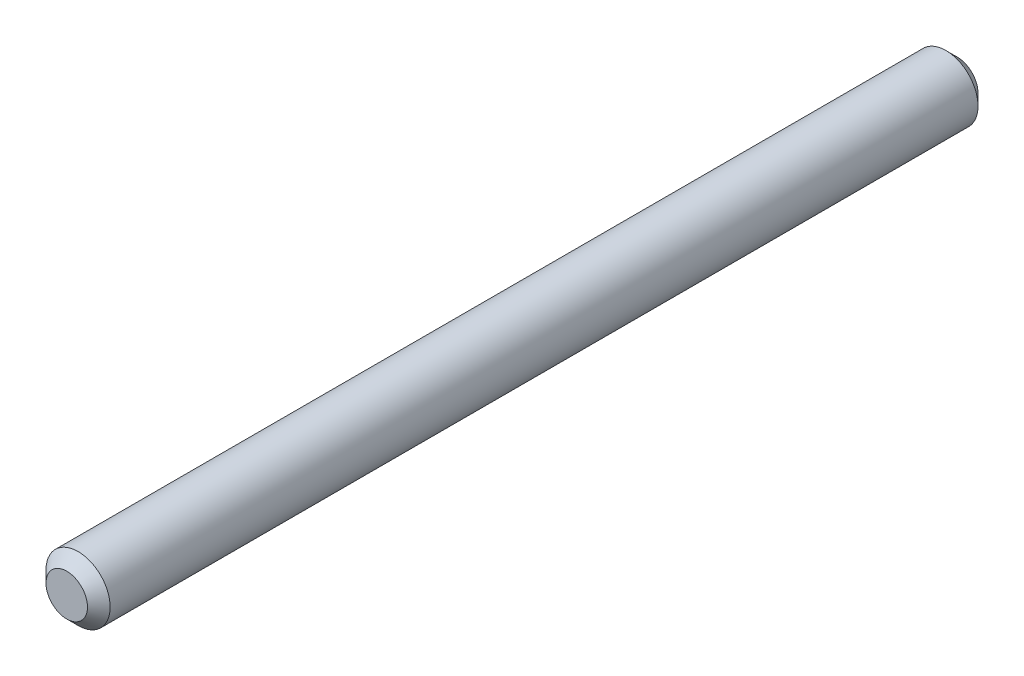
from build123d import *

# Parameters (mm, degrees)
ESQUISSE1_R        = 1.98
BOSS_EXTRU_1_DEPTH = 54.96
CHANFREIN1_SIZE    = 0.7


with BuildPart() as part:
    # Esquisse1 → Boss.-Extru.1 (new body)
    with BuildSketch(Plane.XY):
        with Locations(Location((0, 0, 0), (0, 0, 180))):
            Circle(ESQUISSE1_R)
    extrude(amount=BOSS_EXTRU_1_DEPTH)

    # Chanfrein1
    chanfrein1_edges = [part.edges().sort_by_distance(p)[0] for p in [
        (1.98, 0, 0),
        (1.98, 0, 54.96),
    ]]
    chamfer(chanfrein1_edges, length=CHANFREIN1_SIZE)


solid = part.part
